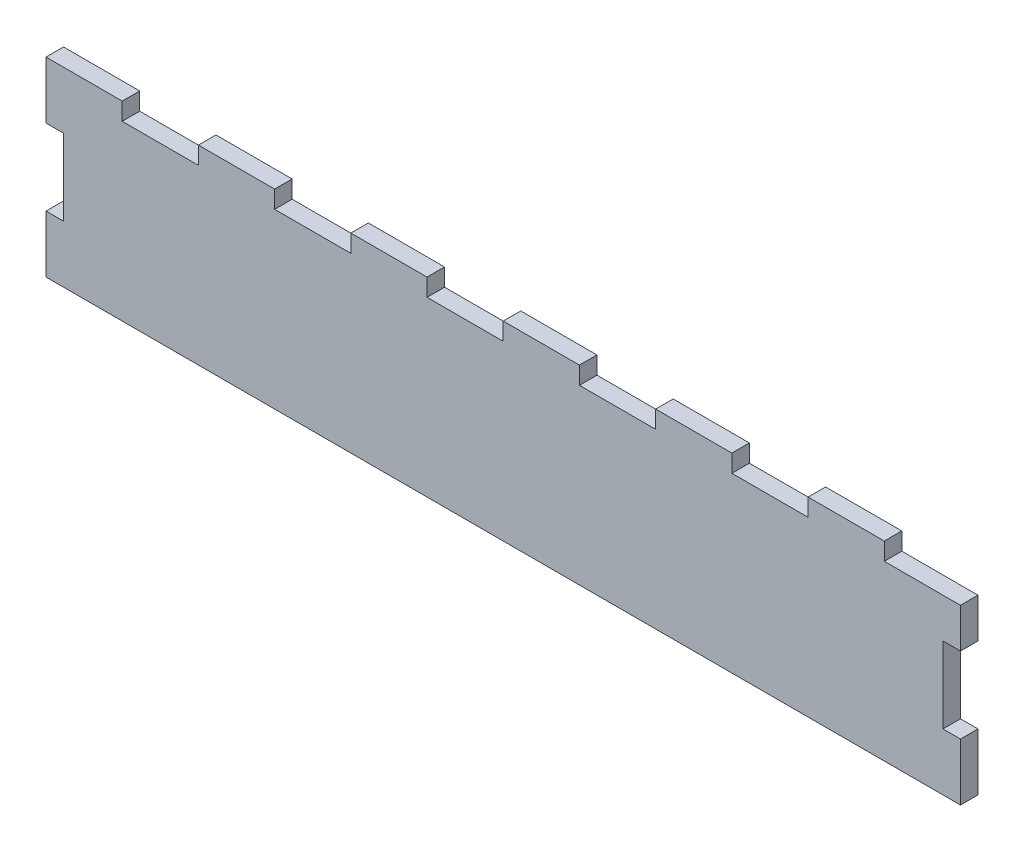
from build123d import *

# Parameters (mm, degrees)
BOSS_EXTRUDE1_DEPTH = 5.842


with BuildPart() as part:
    # Sketch1 → Boss-Extrude1 (new body)
    with BuildSketch(Plane.XY):
        Polygon((-279.4, 63.5), (-279.4, 57.658), (-254, 57.658), (-254, 63.5), (-228.6, 63.5), (-228.6, 57.658), (-203.2, 57.658), (-203.2, 63.5), (-177.8, 63.5), (-177.8, 57.658), (-152.4, 57.658), (-152.4, 63.5), (-127, 63.5), (-127, 57.658), (-101.6, 57.658), (-101.6, 63.5), (-76.2, 63.5), (-76.2, 57.658), (-50.8, 57.658), (-50.8, 63.5), (-25.4, 63.5), (-25.4, 57.658), (0, 57.658), (0, 44.45), (-5.842, 44.45), (-5.842, 19.05), (0, 19.05), (0, 0), (-304.8, 0), (-304.8, 19.05), (-298.958, 19.05), (-298.958, 44.45), (-304.8, 44.45), (-304.8, 63.5), align=None)
    extrude(amount=BOSS_EXTRUDE1_DEPTH)


solid = part.part
